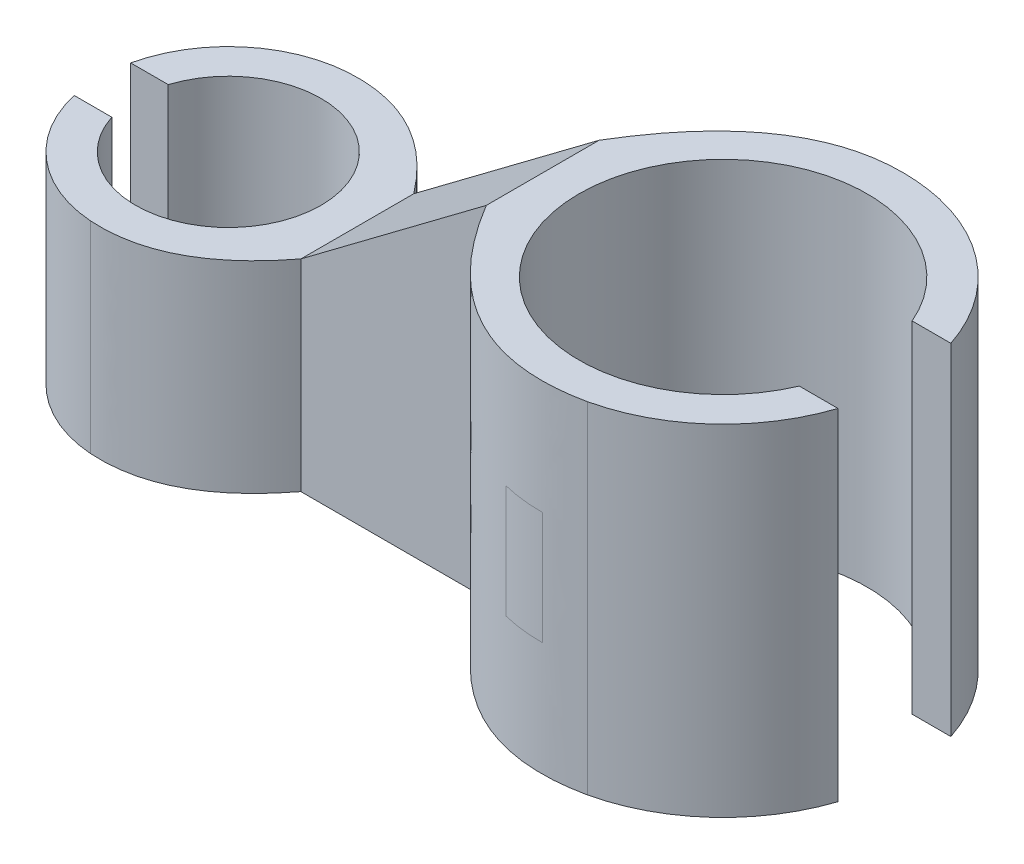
ISO-10303-21;
HEADER;
FILE_DESCRIPTION(('STEP AP214'),'2;1');
FILE_NAME('part.step','',(''),(''),'','','');
FILE_SCHEMA(('AUTOMOTIVE_DESIGN { 1 0 10303 214 1 1 1 1 }'));
ENDSEC;
DATA;
#1=APPLICATION_CONTEXT('core data for automotive mechanical design processes');
#2=APPLICATION_PROTOCOL_DEFINITION('international standard','automotive_design',2000,#1);
#3=PRODUCT_CONTEXT('',#1,'mechanical');
#4=PRODUCT('Part','Part','',(#3));
#5=PRODUCT_RELATED_PRODUCT_CATEGORY('part','',(#4));
#6=PRODUCT_DEFINITION_FORMATION('','',#4);
#7=PRODUCT_DEFINITION_CONTEXT('part definition',#1,'design');
#8=PRODUCT_DEFINITION('design','',#6,#7);
#9=PRODUCT_DEFINITION_SHAPE('','',#8);
#10=(LENGTH_UNIT() NAMED_UNIT(*) SI_UNIT(.MILLI.,.METRE.));
#11=(NAMED_UNIT(*) PLANE_ANGLE_UNIT() SI_UNIT($,.RADIAN.));
#12=(NAMED_UNIT(*) SI_UNIT($,.STERADIAN.) SOLID_ANGLE_UNIT());
#13=UNCERTAINTY_MEASURE_WITH_UNIT(LENGTH_MEASURE(1.E-05),#10,'distance_accuracy_value','');
#14=(GEOMETRIC_REPRESENTATION_CONTEXT(3) GLOBAL_UNCERTAINTY_ASSIGNED_CONTEXT((#13)) GLOBAL_UNIT_ASSIGNED_CONTEXT((#10,
#11,#12)) REPRESENTATION_CONTEXT('',''));
#15=CARTESIAN_POINT('',(0.,0.,0.));
#16=DIRECTION('',(0.,0.,1.));
#17=DIRECTION('',(1.,0.,0.));
#18=AXIS2_PLACEMENT_3D('',#15,#16,#17);
#19=CARTESIAN_POINT('',(0.,16.9,0.));
#20=DIRECTION('',(0.,-1.,0.));
#21=DIRECTION('',(0.,0.,-1.));
#22=AXIS2_PLACEMENT_3D('',#19,#20,#21);
#23=PLANE('',#22);
#24=CARTESIAN_POINT('',(20.4539037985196,16.9,11.2879795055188));
#25=CARTESIAN_POINT('',(19.3948134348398,16.9,11.2948853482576));
#26=CARTESIAN_POINT('',(18.3988784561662,16.9,11.0488560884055));
#27=B_SPLINE_CURVE_WITH_KNOTS('',2,(#24,#25,#26),.UNSPECIFIED.,.F.,.F.,(3,3),(0.673496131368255,
0.843641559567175),.UNSPECIFIED.);
#28=CARTESIAN_POINT('',(18.3988784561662,16.9,11.0488560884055));
#29=VERTEX_POINT('',#28);
#30=CARTESIAN_POINT('',(20.4539037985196,16.9,11.2879795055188));
#31=VERTEX_POINT('',#30);
#32=EDGE_CURVE('E11',#29,#31,#27,.F.);
#33=ORIENTED_EDGE('',*,*,#32,.T.);
#34=CARTESIAN_POINT('',(11.5039037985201,16.9,5.13797950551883));
#35=CARTESIAN_POINT('',(15.8880562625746,16.9,12.4683931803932));
#36=CARTESIAN_POINT('',(22.4537820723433,16.9,11.061682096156));
#37=B_SPLINE_CURVE_WITH_KNOTS('',2,(#34,#35,#36),.UNSPECIFIED.,.F.,.F.,(3,3),(0.,1.),.UNSPECIFIED.);
#38=CARTESIAN_POINT('',(22.4537820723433,16.9,11.061682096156));
#39=VERTEX_POINT('',#38);
#40=EDGE_CURVE('E331',#31,#39,#37,.T.);
#41=ORIENTED_EDGE('',*,*,#40,.T.);
#42=CARTESIAN_POINT('',(20.4539037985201,16.9,2.33797950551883));
#43=DIRECTION('',(0.,-1.,0.));
#44=DIRECTION('',(0.,0.,-1.));
#45=AXIS2_PLACEMENT_3D('',#42,#43,#44);
#46=CIRCLE('',#45,8.95);
#47=CARTESIAN_POINT('',(28.9546390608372,16.9,5.13797950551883));
#48=VERTEX_POINT('',#47);
#49=EDGE_CURVE('E242',#39,#48,#46,.F.);
#50=ORIENTED_EDGE('',*,*,#49,.T.);
#51=DIRECTION('',(1.,0.,0.));
#52=VECTOR('',#51,1.);
#53=CARTESIAN_POINT('',(25.013022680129,16.9,5.13797950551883));
#54=LINE('',#53,#52);
#55=CARTESIAN_POINT('',(27.0328474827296,16.9,5.13797950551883));
#56=VERTEX_POINT('',#55);
#57=EDGE_CURVE('E448',#56,#48,#54,.T.);
#58=ORIENTED_EDGE('',*,*,#57,.F.);
#59=CARTESIAN_POINT('',(20.4539037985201,16.9,2.33797950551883));
#60=DIRECTION('',(0.,-1.,0.));
#61=DIRECTION('',(0.,0.,-1.));
#62=AXIS2_PLACEMENT_3D('',#59,#60,#61);
#63=CIRCLE('',#62,7.15);
#64=CARTESIAN_POINT('',(27.0328474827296,16.9,-0.462020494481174));
#65=VERTEX_POINT('',#64);
#66=EDGE_CURVE('E295',#56,#65,#63,.T.);
#67=ORIENTED_EDGE('',*,*,#66,.T.);
#68=DIRECTION('',(-1.,0.,0.));
#69=VECTOR('',#68,1.);
#70=CARTESIAN_POINT('',(25.013022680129,16.9,-0.462020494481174));
#71=LINE('',#70,#69);
#72=CARTESIAN_POINT('',(28.9546390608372,16.9,-0.462020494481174));
#73=VERTEX_POINT('',#72);
#74=EDGE_CURVE('E446',#73,#65,#71,.T.);
#75=ORIENTED_EDGE('',*,*,#74,.F.);
#76=CARTESIAN_POINT('',(22.4537820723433,16.9,-6.38572308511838));
#77=VERTEX_POINT('',#76);
#78=EDGE_CURVE('E254',#73,#77,#46,.F.);
#79=ORIENTED_EDGE('',*,*,#78,.T.);
#80=CARTESIAN_POINT('',(11.5039037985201,16.9,-0.462020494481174));
#81=CARTESIAN_POINT('',(15.8880562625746,16.9,-7.7924341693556));
#82=CARTESIAN_POINT('',(22.4537820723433,16.9,-6.38572308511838));
#83=B_SPLINE_CURVE_WITH_KNOTS('',2,(#80,#81,#82),.UNSPECIFIED.,.F.,.F.,(3,3),(0.,1.),.UNSPECIFIED.);
#84=CARTESIAN_POINT('',(20.4539037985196,16.9,-6.61202049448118));
#85=VERTEX_POINT('',#84);
#86=EDGE_CURVE('E255',#85,#77,#83,.T.);
#87=ORIENTED_EDGE('',*,*,#86,.F.);
#88=CARTESIAN_POINT('',(18.3988784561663,16.9,-6.37289707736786));
#89=CARTESIAN_POINT('',(19.3948134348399,16.9,-6.61892633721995));
#90=CARTESIAN_POINT('',(20.4539037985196,16.9,-6.61202049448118));
#91=B_SPLINE_CURVE_WITH_KNOTS('',2,(#88,#89,#90),.UNSPECIFIED.,.F.,.F.,(3,3),(0.673496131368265,
0.843641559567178),.UNSPECIFIED.);
#92=CARTESIAN_POINT('',(18.3988784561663,16.9,-6.37289707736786));
#93=VERTEX_POINT('',#92);
#94=EDGE_CURVE('E50',#93,#85,#91,.T.);
#95=ORIENTED_EDGE('',*,*,#94,.F.);
#96=CARTESIAN_POINT('',(11.5039037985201,16.9,-0.462020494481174));
#97=VERTEX_POINT('',#96);
#98=EDGE_CURVE('E251',#97,#93,#83,.T.);
#99=ORIENTED_EDGE('',*,*,#98,.F.);
#100=DIRECTION('',(0.,0.,1.));
#101=VECTOR('',#100,1.);
#102=CARTESIAN_POINT('',(11.5039037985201,16.9,0.));
#103=LINE('',#102,#101);
#104=CARTESIAN_POINT('',(11.5039037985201,16.9,5.13797950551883));
#105=VERTEX_POINT('',#104);
#106=EDGE_CURVE('E241',#97,#105,#103,.T.);
#107=ORIENTED_EDGE('',*,*,#106,.T.);
#108=EDGE_CURVE('E400',#105,#29,#37,.T.);
#109=ORIENTED_EDGE('',*,*,#108,.T.);
#110=EDGE_LOOP('',(#33,#41,#50,#58,#67,#75,#79,#87,#95,#99,#107,#109));
#111=FACE_BOUND('',#110,.T.);
#112=ADVANCED_FACE('F39',(#111),#23,.F.);
#113=CARTESIAN_POINT('',(20.4539037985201,16.9,2.33797950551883));
#114=DIRECTION('',(0.,-1.,0.));
#115=DIRECTION('',(0.,0.,-1.));
#116=AXIS2_PLACEMENT_3D('',#113,#114,#115);
#117=CYLINDRICAL_SURFACE('',#116,8.95);
#118=ORIENTED_EDGE('',*,*,#78,.F.);
#119=DIRECTION('',(0.,-1.,0.));
#120=VECTOR('',#119,1.);
#121=CARTESIAN_POINT('',(28.9546390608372,16.9,-0.462020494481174));
#122=LINE('',#121,#120);
#123=CARTESIAN_POINT('',(28.9546390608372,0.,-0.462020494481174));
#124=VERTEX_POINT('',#123);
#125=EDGE_CURVE('E437',#73,#124,#122,.T.);
#126=ORIENTED_EDGE('',*,*,#125,.T.);
#127=CARTESIAN_POINT('',(20.4539037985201,0.,2.33797950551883));
#128=DIRECTION('',(0.,-1.,0.));
#129=DIRECTION('',(0.,0.,-1.));
#130=AXIS2_PLACEMENT_3D('',#127,#128,#129);
#131=CIRCLE('',#130,8.95);
#132=CARTESIAN_POINT('',(22.4537820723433,0.,-6.38572308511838));
#133=VERTEX_POINT('',#132);
#134=EDGE_CURVE('E322',#124,#133,#131,.F.);
#135=ORIENTED_EDGE('',*,*,#134,.T.);
#136=DIRECTION('',(0.,-1.,0.));
#137=VECTOR('',#136,1.);
#138=CARTESIAN_POINT('',(22.4537820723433,16.9,-6.38572308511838));
#139=LINE('',#138,#137);
#140=EDGE_CURVE('E303',#77,#133,#139,.T.);
#141=ORIENTED_EDGE('',*,*,#140,.F.);
#142=EDGE_LOOP('',(#118,#126,#135,#141));
#143=FACE_BOUND('',#142,.T.);
#144=ADVANCED_FACE('F282',(#143),#117,.T.);
#145=CARTESIAN_POINT('',(-4.09609620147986,10.,2.33797950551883));
#146=DIRECTION('',(0.,-1.,0.));
#147=DIRECTION('',(0.,0.,-1.));
#148=AXIS2_PLACEMENT_3D('',#145,#146,#147);
#149=CYLINDRICAL_SURFACE('',#148,6.4);
#150=CARTESIAN_POINT('',(-4.09609620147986,0.,2.33797950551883));
#151=DIRECTION('',(0.,1.,0.));
#152=DIRECTION('',(0.,0.,1.));
#153=AXIS2_PLACEMENT_3D('',#150,#151,#152);
#154=CIRCLE('',#153,6.4);
#155=CARTESIAN_POINT('',(-4.53794079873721,0.,-4.0467501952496));
#156=VERTEX_POINT('',#155);
#157=CARTESIAN_POINT('',(-10.3410941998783,0.,0.937979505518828));
#158=VERTEX_POINT('',#157);
#159=EDGE_CURVE('E371',#156,#158,#154,.T.);
#160=ORIENTED_EDGE('',*,*,#159,.T.);
#161=DIRECTION('',(0.,-1.,0.));
#162=VECTOR('',#161,1.);
#163=CARTESIAN_POINT('',(-10.3410941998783,10.,0.937979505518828));
#164=LINE('',#163,#162);
#165=CARTESIAN_POINT('',(-10.3410941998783,10.,0.937979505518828));
#166=VERTEX_POINT('',#165);
#167=EDGE_CURVE('E422',#158,#166,#164,.F.);
#168=ORIENTED_EDGE('',*,*,#167,.T.);
#169=CARTESIAN_POINT('',(-4.09609620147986,10.,2.33797950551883));
#170=DIRECTION('',(0.,1.,0.));
#171=DIRECTION('',(0.,0.,1.));
#172=AXIS2_PLACEMENT_3D('',#169,#170,#171);
#173=CIRCLE('',#172,6.4);
#174=CARTESIAN_POINT('',(-4.53794079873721,10.,-4.0467501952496));
#175=VERTEX_POINT('',#174);
#176=EDGE_CURVE('E551',#175,#166,#173,.T.);
#177=ORIENTED_EDGE('',*,*,#176,.F.);
#178=DIRECTION('',(0.,-1.,0.));
#179=VECTOR('',#178,1.);
#180=CARTESIAN_POINT('',(-4.53794079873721,10.,-4.0467501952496));
#181=LINE('',#180,#179);
#182=EDGE_CURVE('E384',#175,#156,#181,.T.);
#183=ORIENTED_EDGE('',*,*,#182,.T.);
#184=EDGE_LOOP('',(#160,#168,#177,#183));
#185=FACE_BOUND('',#184,.T.);
#186=ADVANCED_FACE('F573',(#185),#149,.T.);
#187=CARTESIAN_POINT('',(2.30390379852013,10.,5.13797950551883));
#188=CARTESIAN_POINT('',(-0.619440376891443,10.,8.97316679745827));
#189=CARTESIAN_POINT('',(-4.53794079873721,10.,8.72270920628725));
#190=B_SPLINE_CURVE_WITH_KNOTS('',2,(#187,#188,#189),.UNSPECIFIED.,.F.,.F.,(3,3),(0.,1.),.UNSPECIFIED.);
#191=DIRECTION('',(0.,-1.,0.));
#192=VECTOR('',#191,1.);
#193=SURFACE_OF_LINEAR_EXTRUSION('',#190,#192);
#194=CARTESIAN_POINT('',(2.30390379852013,0.,5.13797950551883));
#195=CARTESIAN_POINT('',(-0.619440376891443,0.,8.97316679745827));
#196=CARTESIAN_POINT('',(-4.53794079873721,0.,8.72270920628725));
#197=B_SPLINE_CURVE_WITH_KNOTS('',2,(#194,#195,#196),.UNSPECIFIED.,.F.,.F.,(3,3),(0.,1.),.UNSPECIFIED.);
#198=CARTESIAN_POINT('',(2.30390379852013,0.,5.13797950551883));
#199=VERTEX_POINT('',#198);
#200=CARTESIAN_POINT('',(-4.53794079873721,0.,8.72270920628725));
#201=VERTEX_POINT('',#200);
#202=EDGE_CURVE('E333',#199,#201,#197,.T.);
#203=ORIENTED_EDGE('',*,*,#202,.F.);
#204=DIRECTION('',(0.,-1.,0.));
#205=VECTOR('',#204,1.);
#206=CARTESIAN_POINT('',(2.30390379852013,10.,5.13797950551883));
#207=LINE('',#206,#205);
#208=CARTESIAN_POINT('',(2.30390379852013,10.,5.13797950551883));
#209=VERTEX_POINT('',#208);
#210=EDGE_CURVE('E392',#209,#199,#207,.T.);
#211=ORIENTED_EDGE('',*,*,#210,.F.);
#212=CARTESIAN_POINT('',(-4.53794079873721,10.,8.72270920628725));
#213=VERTEX_POINT('',#212);
#214=EDGE_CURVE('E380',#209,#213,#190,.T.);
#215=ORIENTED_EDGE('',*,*,#214,.T.);
#216=DIRECTION('',(0.,-1.,0.));
#217=VECTOR('',#216,1.);
#218=CARTESIAN_POINT('',(-4.53794079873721,10.,8.72270920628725));
#219=LINE('',#218,#217);
#220=EDGE_CURVE('E381',#213,#201,#219,.T.);
#221=ORIENTED_EDGE('',*,*,#220,.T.);
#222=EDGE_LOOP('',(#203,#211,#215,#221));
#223=FACE_BOUND('',#222,.T.);
#224=ADVANCED_FACE('F41',(#223),#193,.T.);
#225=CARTESIAN_POINT('',(0.,10.,5.13797950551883));
#226=DIRECTION('',(0.,0.,-1.));
#227=DIRECTION('',(-1.,0.,0.));
#228=AXIS2_PLACEMENT_3D('',#225,#226,#227);
#229=PLANE('',#228);
#230=DIRECTION('',(1.,0.,0.));
#231=VECTOR('',#230,1.);
#232=CARTESIAN_POINT('',(0.,0.,5.13797950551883));
#233=LINE('',#232,#231);
#234=CARTESIAN_POINT('',(11.5039037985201,0.,5.13797950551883));
#235=VERTEX_POINT('',#234);
#236=EDGE_CURVE('E346',#199,#235,#233,.T.);
#237=ORIENTED_EDGE('',*,*,#236,.T.);
#238=DIRECTION('',(0.,-1.,0.));
#239=VECTOR('',#238,1.);
#240=CARTESIAN_POINT('',(11.5039037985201,10.,5.13797950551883));
#241=LINE('',#240,#239);
#242=EDGE_CURVE('E44',#105,#235,#241,.T.);
#243=ORIENTED_EDGE('',*,*,#242,.F.);
#244=DIRECTION('',(0.8,0.6,0.));
#245=VECTOR('',#244,1.);
#246=CARTESIAN_POINT('',(2.30390379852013,10.,5.13797950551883));
#247=LINE('',#246,#245);
#248=EDGE_CURVE('E414',#209,#105,#247,.T.);
#249=ORIENTED_EDGE('',*,*,#248,.F.);
#250=ORIENTED_EDGE('',*,*,#210,.T.);
#251=EDGE_LOOP('',(#237,#243,#249,#250));
#252=FACE_BOUND('',#251,.T.);
#253=ADVANCED_FACE('F519',(#252),#229,.F.);
#254=CARTESIAN_POINT('',(0.,10.,-0.462020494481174));
#255=DIRECTION('',(0.,0.,-1.));
#256=DIRECTION('',(-1.,0.,0.));
#257=AXIS2_PLACEMENT_3D('',#254,#255,#256);
#258=PLANE('',#257);
#259=DIRECTION('',(1.,0.,0.));
#260=VECTOR('',#259,1.);
#261=CARTESIAN_POINT('',(0.,0.,-0.462020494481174));
#262=LINE('',#261,#260);
#263=CARTESIAN_POINT('',(2.30390379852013,0.,-0.462020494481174));
#264=VERTEX_POINT('',#263);
#265=CARTESIAN_POINT('',(11.5039037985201,0.,-0.462020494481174));
#266=VERTEX_POINT('',#265);
#267=EDGE_CURVE('E353',#264,#266,#262,.T.);
#268=ORIENTED_EDGE('',*,*,#267,.F.);
#269=DIRECTION('',(0.,-1.,0.));
#270=VECTOR('',#269,1.);
#271=CARTESIAN_POINT('',(2.30390379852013,10.,-0.462020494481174));
#272=LINE('',#271,#270);
#273=CARTESIAN_POINT('',(2.30390379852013,10.,-0.462020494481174));
#274=VERTEX_POINT('',#273);
#275=EDGE_CURVE('E387',#274,#264,#272,.T.);
#276=ORIENTED_EDGE('',*,*,#275,.F.);
#277=DIRECTION('',(0.8,0.6,0.));
#278=VECTOR('',#277,1.);
#279=CARTESIAN_POINT('',(2.30390379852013,10.,-0.462020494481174));
#280=LINE('',#279,#278);
#281=EDGE_CURVE('E415',#274,#97,#280,.T.);
#282=ORIENTED_EDGE('',*,*,#281,.T.);
#283=DIRECTION('',(0.,-1.,0.));
#284=VECTOR('',#283,1.);
#285=CARTESIAN_POINT('',(11.5039037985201,10.,-0.462020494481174));
#286=LINE('',#285,#284);
#287=EDGE_CURVE('E389',#97,#266,#286,.T.);
#288=ORIENTED_EDGE('',*,*,#287,.T.);
#289=EDGE_LOOP('',(#268,#276,#282,#288));
#290=FACE_BOUND('',#289,.T.);
#291=ADVANCED_FACE('F539',(#290),#258,.T.);
#292=CARTESIAN_POINT('',(2.30390379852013,10.,-0.462020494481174));
#293=CARTESIAN_POINT('',(-0.619440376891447,10.,-4.29720778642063));
#294=CARTESIAN_POINT('',(-4.53794079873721,10.,-4.0467501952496));
#295=B_SPLINE_CURVE_WITH_KNOTS('',2,(#292,#293,#294),.UNSPECIFIED.,.F.,.F.,(3,3),(0.,1.),.UNSPECIFIED.);
#296=DIRECTION('',(0.,-1.,0.));
#297=VECTOR('',#296,1.);
#298=SURFACE_OF_LINEAR_EXTRUSION('',#295,#297);
#299=CARTESIAN_POINT('',(2.30390379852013,0.,-0.462020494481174));
#300=CARTESIAN_POINT('',(-0.619440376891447,0.,-4.29720778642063));
#301=CARTESIAN_POINT('',(-4.53794079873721,0.,-4.0467501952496));
#302=B_SPLINE_CURVE_WITH_KNOTS('',2,(#299,#300,#301),.UNSPECIFIED.,.F.,.F.,(3,3),(0.,1.),.UNSPECIFIED.);
#303=EDGE_CURVE('E366',#264,#156,#302,.T.);
#304=ORIENTED_EDGE('',*,*,#303,.T.);
#305=ORIENTED_EDGE('',*,*,#182,.F.);
#306=EDGE_CURVE('E544',#274,#175,#295,.T.);
#307=ORIENTED_EDGE('',*,*,#306,.F.);
#308=ORIENTED_EDGE('',*,*,#275,.T.);
#309=EDGE_LOOP('',(#304,#305,#307,#308));
#310=FACE_BOUND('',#309,.T.);
#311=ADVANCED_FACE('F545',(#310),#298,.F.);
#312=CARTESIAN_POINT('',(-10.3410941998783,10.,3.73797950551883));
#313=VERTEX_POINT('',#312);
#314=EDGE_CURVE('E549',#313,#213,#173,.T.);
#315=ORIENTED_EDGE('',*,*,#314,.F.);
#316=DIRECTION('',(0.,-1.,0.));
#317=VECTOR('',#316,1.);
#318=CARTESIAN_POINT('',(-10.3410941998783,10.,3.73797950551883));
#319=LINE('',#318,#317);
#320=CARTESIAN_POINT('',(-10.3410941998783,0.,3.73797950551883));
#321=VERTEX_POINT('',#320);
#322=EDGE_CURVE('E429',#313,#321,#319,.T.);
#323=ORIENTED_EDGE('',*,*,#322,.T.);
#324=EDGE_CURVE('E370',#321,#201,#154,.T.);
#325=ORIENTED_EDGE('',*,*,#324,.T.);
#326=ORIENTED_EDGE('',*,*,#220,.F.);
#327=EDGE_LOOP('',(#315,#323,#325,#326));
#328=FACE_BOUND('',#327,.T.);
#329=ADVANCED_FACE('F566',(#328),#149,.T.);
#330=CARTESIAN_POINT('',(-4.09609620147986,10.,2.33797950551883));
#331=DIRECTION('',(0.,-1.,0.));
#332=DIRECTION('',(0.,0.,-1.));
#333=AXIS2_PLACEMENT_3D('',#330,#331,#332);
#334=CYLINDRICAL_SURFACE('',#333,4.6);
#335=DIRECTION('',(0.,-1.,0.));
#336=VECTOR('',#335,1.);
#337=CARTESIAN_POINT('',(-8.47787666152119,10.,0.937979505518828));
#338=LINE('',#337,#336);
#339=CARTESIAN_POINT('',(-8.47787666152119,0.,0.937979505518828));
#340=VERTEX_POINT('',#339);
#341=CARTESIAN_POINT('',(-8.47787666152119,10.,0.937979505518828));
#342=VERTEX_POINT('',#341);
#343=EDGE_CURVE('E425',#340,#342,#338,.F.);
#344=ORIENTED_EDGE('',*,*,#343,.F.);
#345=CARTESIAN_POINT('',(-4.09609620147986,0.,2.33797950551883));
#346=DIRECTION('',(0.,1.,0.));
#347=DIRECTION('',(0.,0.,1.));
#348=AXIS2_PLACEMENT_3D('',#345,#346,#347);
#349=CIRCLE('',#348,4.6);
#350=CARTESIAN_POINT('',(-8.47787666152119,0.,3.73797950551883));
#351=VERTEX_POINT('',#350);
#352=EDGE_CURVE('E377',#351,#340,#349,.T.);
#353=ORIENTED_EDGE('',*,*,#352,.F.);
#354=DIRECTION('',(0.,-1.,0.));
#355=VECTOR('',#354,1.);
#356=CARTESIAN_POINT('',(-8.47787666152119,10.,3.73797950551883));
#357=LINE('',#356,#355);
#358=CARTESIAN_POINT('',(-8.47787666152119,10.,3.73797950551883));
#359=VERTEX_POINT('',#358);
#360=EDGE_CURVE('E432',#359,#351,#357,.T.);
#361=ORIENTED_EDGE('',*,*,#360,.F.);
#362=CARTESIAN_POINT('',(-4.09609620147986,10.,2.33797950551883));
#363=DIRECTION('',(0.,1.,0.));
#364=DIRECTION('',(0.,0.,1.));
#365=AXIS2_PLACEMENT_3D('',#362,#363,#364);
#366=CIRCLE('',#365,4.6);
#367=EDGE_CURVE('E358',#359,#342,#366,.T.);
#368=ORIENTED_EDGE('',*,*,#367,.T.);
#369=EDGE_LOOP('',(#344,#353,#361,#368));
#370=FACE_BOUND('',#369,.T.);
#371=ADVANCED_FACE('F588',(#370),#334,.F.);
#372=CARTESIAN_POINT('',(0.,10.,0.));
#373=DIRECTION('',(0.,1.,0.));
#374=DIRECTION('',(0.,0.,1.));
#375=AXIS2_PLACEMENT_3D('',#372,#373,#374);
#376=PLANE('',#375);
#377=DIRECTION('',(-1.,0.,0.));
#378=VECTOR('',#377,1.);
#379=CARTESIAN_POINT('',(0.,10.,0.937979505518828));
#380=LINE('',#379,#378);
#381=EDGE_CURVE('E418',#342,#166,#380,.T.);
#382=ORIENTED_EDGE('',*,*,#381,.F.);
#383=ORIENTED_EDGE('',*,*,#367,.F.);
#384=DIRECTION('',(1.,0.,0.));
#385=VECTOR('',#384,1.);
#386=CARTESIAN_POINT('',(0.,10.,3.73797950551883));
#387=LINE('',#386,#385);
#388=EDGE_CURVE('E427',#313,#359,#387,.T.);
#389=ORIENTED_EDGE('',*,*,#388,.F.);
#390=ORIENTED_EDGE('',*,*,#314,.T.);
#391=ORIENTED_EDGE('',*,*,#214,.F.);
#392=DIRECTION('',(0.,0.,-1.));
#393=VECTOR('',#392,1.);
#394=CARTESIAN_POINT('',(2.30390379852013,10.,5.13797950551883));
#395=LINE('',#394,#393);
#396=EDGE_CURVE('E314',#209,#274,#395,.T.);
#397=ORIENTED_EDGE('',*,*,#396,.T.);
#398=ORIENTED_EDGE('',*,*,#306,.T.);
#399=ORIENTED_EDGE('',*,*,#176,.T.);
#400=EDGE_LOOP('',(#382,#383,#389,#390,#391,#397,#398,#399));
#401=FACE_BOUND('',#400,.T.);
#402=ADVANCED_FACE('F594',(#401),#376,.T.);
#403=CARTESIAN_POINT('',(0.,0.,0.));
#404=DIRECTION('',(0.,1.,0.));
#405=DIRECTION('',(0.,0.,1.));
#406=AXIS2_PLACEMENT_3D('',#403,#404,#405);
#407=PLANE('',#406);
#408=ORIENTED_EDGE('',*,*,#134,.F.);
#409=DIRECTION('',(-1.,0.,0.));
#410=VECTOR('',#409,1.);
#411=CARTESIAN_POINT('',(0.,0.,-0.462020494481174));
#412=LINE('',#411,#410);
#413=CARTESIAN_POINT('',(27.0328474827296,0.,-0.462020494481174));
#414=VERTEX_POINT('',#413);
#415=EDGE_CURVE('E434',#124,#414,#412,.T.);
#416=ORIENTED_EDGE('',*,*,#415,.T.);
#417=CARTESIAN_POINT('',(20.4539037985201,0.,2.33797950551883));
#418=DIRECTION('',(0.,-1.,0.));
#419=DIRECTION('',(0.,0.,-1.));
#420=AXIS2_PLACEMENT_3D('',#417,#418,#419);
#421=CIRCLE('',#420,7.15);
#422=CARTESIAN_POINT('',(27.0328474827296,0.,5.13797950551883));
#423=VERTEX_POINT('',#422);
#424=EDGE_CURVE('E329',#423,#414,#421,.T.);
#425=ORIENTED_EDGE('',*,*,#424,.F.);
#426=DIRECTION('',(1.,0.,0.));
#427=VECTOR('',#426,1.);
#428=CARTESIAN_POINT('',(0.,0.,5.13797950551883));
#429=LINE('',#428,#427);
#430=CARTESIAN_POINT('',(28.9546390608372,0.,5.13797950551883));
#431=VERTEX_POINT('',#430);
#432=EDGE_CURVE('E440',#423,#431,#429,.T.);
#433=ORIENTED_EDGE('',*,*,#432,.T.);
#434=CARTESIAN_POINT('',(22.4537820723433,0.,11.061682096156));
#435=VERTEX_POINT('',#434);
#436=EDGE_CURVE('E323',#435,#431,#131,.F.);
#437=ORIENTED_EDGE('',*,*,#436,.F.);
#438=CARTESIAN_POINT('',(11.5039037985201,0.,5.13797950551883));
#439=CARTESIAN_POINT('',(15.8880562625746,0.,12.4683931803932));
#440=CARTESIAN_POINT('',(22.4537820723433,0.,11.061682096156));
#441=B_SPLINE_CURVE_WITH_KNOTS('',2,(#438,#439,#440),.UNSPECIFIED.,.F.,.F.,(3,3),(0.,1.),.UNSPECIFIED.);
#442=EDGE_CURVE('E308',#235,#435,#441,.T.);
#443=ORIENTED_EDGE('',*,*,#442,.F.);
#444=ORIENTED_EDGE('',*,*,#236,.F.);
#445=ORIENTED_EDGE('',*,*,#202,.T.);
#446=ORIENTED_EDGE('',*,*,#324,.F.);
#447=DIRECTION('',(1.,0.,0.));
#448=VECTOR('',#447,1.);
#449=CARTESIAN_POINT('',(0.,0.,3.73797950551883));
#450=LINE('',#449,#448);
#451=EDGE_CURVE('E394',#321,#351,#450,.T.);
#452=ORIENTED_EDGE('',*,*,#451,.T.);
#453=ORIENTED_EDGE('',*,*,#352,.T.);
#454=DIRECTION('',(-1.,0.,0.));
#455=VECTOR('',#454,1.);
#456=CARTESIAN_POINT('',(0.,0.,0.937979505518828));
#457=LINE('',#456,#455);
#458=EDGE_CURVE('E397',#340,#158,#457,.T.);
#459=ORIENTED_EDGE('',*,*,#458,.T.);
#460=ORIENTED_EDGE('',*,*,#159,.F.);
#461=ORIENTED_EDGE('',*,*,#303,.F.);
#462=ORIENTED_EDGE('',*,*,#267,.T.);
#463=CARTESIAN_POINT('',(11.5039037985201,0.,-0.462020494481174));
#464=CARTESIAN_POINT('',(15.8880562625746,0.,-7.7924341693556));
#465=CARTESIAN_POINT('',(22.4537820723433,0.,-6.38572308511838));
#466=B_SPLINE_CURVE_WITH_KNOTS('',2,(#463,#464,#465),.UNSPECIFIED.,.F.,.F.,(3,3),(0.,1.),.UNSPECIFIED.);
#467=EDGE_CURVE('E313',#266,#133,#466,.T.);
#468=ORIENTED_EDGE('',*,*,#467,.T.);
#469=EDGE_LOOP('',(#408,#416,#425,#433,#437,#443,#444,#445,#446,#452,#453,#459,#460,#461,#462,#468));
#470=FACE_BOUND('',#469,.T.);
#471=ADVANCED_FACE('F515',(#470),#407,.F.);
#472=DIRECTION('',(0.,-1.,0.));
#473=VECTOR('',#472,1.);
#474=SURFACE_OF_LINEAR_EXTRUSION('',#37,#473);
#475=DIRECTION('',(0.,1.,0.));
#476=VECTOR('',#475,1.);
#477=CARTESIAN_POINT('',(20.4539037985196,1.89999999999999,11.2879795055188));
#478=LINE('',#477,#476);
#479=CARTESIAN_POINT('',(20.4539037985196,5.65,11.2879795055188));
#480=VERTEX_POINT('',#479);
#481=CARTESIAN_POINT('',(20.4539037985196,11.25,11.2879795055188));
#482=VERTEX_POINT('',#481);
#483=EDGE_CURVE('E204',#480,#482,#478,.T.);
#484=ORIENTED_EDGE('',*,*,#483,.F.);
#485=CARTESIAN_POINT('',(20.4539037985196,5.65,11.2879795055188));
#486=CARTESIAN_POINT('',(19.3948134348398,5.65,11.2948853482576));
#487=CARTESIAN_POINT('',(18.3988784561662,5.65,11.0488560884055));
#488=B_SPLINE_CURVE_WITH_KNOTS('',2,(#485,#486,#487),.UNSPECIFIED.,.F.,.F.,(3,3),
(0.673496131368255,0.843641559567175),.UNSPECIFIED.);
#489=CARTESIAN_POINT('',(18.3988784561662,5.65,11.0488560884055));
#490=VERTEX_POINT('',#489);
#491=EDGE_CURVE('E203',#490,#480,#488,.F.);
#492=ORIENTED_EDGE('',*,*,#491,.F.);
#493=DIRECTION('',(0.,1.,0.));
#494=VECTOR('',#493,1.);
#495=CARTESIAN_POINT('',(18.3988784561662,1.89999999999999,11.0488560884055));
#496=LINE('',#495,#494);
#497=CARTESIAN_POINT('',(18.3988784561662,11.25,11.0488560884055));
#498=VERTEX_POINT('',#497);
#499=EDGE_CURVE('E495',#490,#498,#496,.T.);
#500=ORIENTED_EDGE('',*,*,#499,.T.);
#501=CARTESIAN_POINT('',(18.3988784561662,11.25,11.0488560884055));
#502=CARTESIAN_POINT('',(19.3948134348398,11.25,11.2948853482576));
#503=CARTESIAN_POINT('',(20.4539037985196,11.25,11.2879795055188));
#504=B_SPLINE_CURVE_WITH_KNOTS('',2,(#501,#502,#503),.UNSPECIFIED.,.F.,.F.,(3,3),
(0.673496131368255,0.843641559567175),.UNSPECIFIED.);
#505=EDGE_CURVE('E492',#498,#482,#504,.T.);
#506=ORIENTED_EDGE('',*,*,#505,.T.);
#507=EDGE_LOOP('',(#484,#492,#500,#506));
#508=FACE_BOUND('',#507,.T.);
#509=ORIENTED_EDGE('',*,*,#242,.T.);
#510=ORIENTED_EDGE('',*,*,#442,.T.);
#511=DIRECTION('',(0.,-1.,0.));
#512=VECTOR('',#511,1.);
#513=CARTESIAN_POINT('',(22.4537820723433,16.9,11.061682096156));
#514=LINE('',#513,#512);
#515=EDGE_CURVE('E304',#39,#435,#514,.T.);
#516=ORIENTED_EDGE('',*,*,#515,.F.);
#517=ORIENTED_EDGE('',*,*,#40,.F.);
#518=ORIENTED_EDGE('',*,*,#32,.F.);
#519=ORIENTED_EDGE('',*,*,#108,.F.);
#520=EDGE_LOOP('',(#509,#510,#516,#517,#518,#519));
#521=FACE_BOUND('',#520,.T.);
#522=ADVANCED_FACE('F229',(#508,#521),#474,.F.);
#523=ORIENTED_EDGE('',*,*,#515,.T.);
#524=ORIENTED_EDGE('',*,*,#436,.T.);
#525=DIRECTION('',(0.,-1.,0.));
#526=VECTOR('',#525,1.);
#527=CARTESIAN_POINT('',(28.9546390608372,16.9,5.13797950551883));
#528=LINE('',#527,#526);
#529=EDGE_CURVE('E443',#431,#48,#528,.F.);
#530=ORIENTED_EDGE('',*,*,#529,.T.);
#531=ORIENTED_EDGE('',*,*,#49,.F.);
#532=EDGE_LOOP('',(#523,#524,#530,#531));
#533=FACE_BOUND('',#532,.T.);
#534=ADVANCED_FACE('F227',(#533),#117,.T.);
#535=DIRECTION('',(0.,-1.,0.));
#536=VECTOR('',#535,1.);
#537=SURFACE_OF_LINEAR_EXTRUSION('',#83,#536);
#538=CARTESIAN_POINT('',(18.3988784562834,5.65,-6.37289707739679));
#539=CARTESIAN_POINT('',(19.3948134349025,5.65,-6.61892633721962));
#540=CARTESIAN_POINT('',(20.4539037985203,5.65,-6.61202049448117));
#541=B_SPLINE_CURVE_WITH_KNOTS('',2,(#538,#539,#540),.UNSPECIFIED.,.F.,.F.,(3,3),
(0.673496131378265,0.843641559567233),.UNSPECIFIED.);
#542=CARTESIAN_POINT('',(20.4539037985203,5.65,-6.61202049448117));
#543=VERTEX_POINT('',#542);
#544=CARTESIAN_POINT('',(18.3988784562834,5.65,-6.37289707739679));
#545=VERTEX_POINT('',#544);
#546=EDGE_CURVE('E191',#543,#545,#541,.F.);
#547=ORIENTED_EDGE('',*,*,#546,.F.);
#548=DIRECTION('',(0.,1.,0.));
#549=VECTOR('',#548,1.);
#550=CARTESIAN_POINT('',(20.4539037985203,1.89999999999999,-6.61202049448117));
#551=LINE('',#550,#549);
#552=CARTESIAN_POINT('',(20.4539037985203,11.25,-6.61202049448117));
#553=VERTEX_POINT('',#552);
#554=EDGE_CURVE('E188',#543,#553,#551,.T.);
#555=ORIENTED_EDGE('',*,*,#554,.T.);
#556=CARTESIAN_POINT('',(20.4539037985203,11.25,-6.61202049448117));
#557=CARTESIAN_POINT('',(19.3948134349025,11.25,-6.61892633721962));
#558=CARTESIAN_POINT('',(18.3988784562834,11.25,-6.37289707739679));
#559=B_SPLINE_CURVE_WITH_KNOTS('',2,(#556,#557,#558),.UNSPECIFIED.,.F.,.F.,(3,3),
(0.673496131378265,0.843641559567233),.UNSPECIFIED.);
#560=CARTESIAN_POINT('',(18.3988784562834,11.25,-6.37289707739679));
#561=VERTEX_POINT('',#560);
#562=EDGE_CURVE('E195',#553,#561,#559,.T.);
#563=ORIENTED_EDGE('',*,*,#562,.T.);
#564=DIRECTION('',(0.,1.,0.));
#565=VECTOR('',#564,1.);
#566=CARTESIAN_POINT('',(18.3988784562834,1.89999999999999,-6.37289707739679));
#567=LINE('',#566,#565);
#568=EDGE_CURVE('E198',#545,#561,#567,.T.);
#569=ORIENTED_EDGE('',*,*,#568,.F.);
#570=EDGE_LOOP('',(#547,#555,#563,#569));
#571=FACE_BOUND('',#570,.T.);
#572=ORIENTED_EDGE('',*,*,#467,.F.);
#573=ORIENTED_EDGE('',*,*,#287,.F.);
#574=ORIENTED_EDGE('',*,*,#98,.T.);
#575=ORIENTED_EDGE('',*,*,#94,.T.);
#576=ORIENTED_EDGE('',*,*,#86,.T.);
#577=ORIENTED_EDGE('',*,*,#140,.T.);
#578=EDGE_LOOP('',(#572,#573,#574,#575,#576,#577));
#579=FACE_BOUND('',#578,.T.);
#580=ADVANCED_FACE('F201',(#571,#579),#537,.T.);
#581=CARTESIAN_POINT('',(20.4539037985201,16.9,2.33797950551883));
#582=DIRECTION('',(0.,-1.,0.));
#583=DIRECTION('',(0.,0.,-1.));
#584=AXIS2_PLACEMENT_3D('',#581,#582,#583);
#585=CYLINDRICAL_SURFACE('',#584,7.15);
#586=ORIENTED_EDGE('',*,*,#66,.F.);
#587=DIRECTION('',(0.,-1.,0.));
#588=VECTOR('',#587,1.);
#589=CARTESIAN_POINT('',(27.0328474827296,16.9,5.13797950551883));
#590=LINE('',#589,#588);
#591=EDGE_CURVE('E297',#56,#423,#590,.T.);
#592=ORIENTED_EDGE('',*,*,#591,.T.);
#593=ORIENTED_EDGE('',*,*,#424,.T.);
#594=DIRECTION('',(0.,-1.,0.));
#595=VECTOR('',#594,1.);
#596=CARTESIAN_POINT('',(27.0328474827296,16.9,-0.462020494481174));
#597=LINE('',#596,#595);
#598=EDGE_CURVE('E299',#414,#65,#597,.F.);
#599=ORIENTED_EDGE('',*,*,#598,.T.);
#600=EDGE_LOOP('',(#586,#592,#593,#599));
#601=FACE_BOUND('',#600,.T.);
#602=ADVANCED_FACE('F226',(#601),#585,.F.);
#603=CARTESIAN_POINT('',(2.30390379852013,10.,5.13797950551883));
#604=DIRECTION('',(-0.6,0.8,0.));
#605=DIRECTION('',(-0.8,-0.6,0.));
#606=AXIS2_PLACEMENT_3D('',#603,#604,#605);
#607=PLANE('',#606);
#608=ORIENTED_EDGE('',*,*,#281,.F.);
#609=ORIENTED_EDGE('',*,*,#396,.F.);
#610=ORIENTED_EDGE('',*,*,#248,.T.);
#611=ORIENTED_EDGE('',*,*,#106,.F.);
#612=EDGE_LOOP('',(#608,#609,#610,#611));
#613=FACE_BOUND('',#612,.T.);
#614=ADVANCED_FACE('F283',(#613),#607,.T.);
#615=CARTESIAN_POINT('',(-12.0850769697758,-1.70000000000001,3.73797950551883));
#616=DIRECTION('',(0.,0.,1.));
#617=DIRECTION('',(1.,0.,0.));
#618=AXIS2_PLACEMENT_3D('',#615,#616,#617);
#619=PLANE('',#618);
#620=ORIENTED_EDGE('',*,*,#388,.T.);
#621=ORIENTED_EDGE('',*,*,#360,.T.);
#622=ORIENTED_EDGE('',*,*,#451,.F.);
#623=ORIENTED_EDGE('',*,*,#322,.F.);
#624=EDGE_LOOP('',(#620,#621,#622,#623));
#625=FACE_BOUND('',#624,.T.);
#626=ADVANCED_FACE('F291',(#625),#619,.F.);
#627=CARTESIAN_POINT('',(-12.0850769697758,-1.70000000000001,0.937979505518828));
#628=DIRECTION('',(0.,0.,-1.));
#629=DIRECTION('',(-1.,0.,0.));
#630=AXIS2_PLACEMENT_3D('',#627,#628,#629);
#631=PLANE('',#630);
#632=ORIENTED_EDGE('',*,*,#381,.T.);
#633=ORIENTED_EDGE('',*,*,#167,.F.);
#634=ORIENTED_EDGE('',*,*,#458,.F.);
#635=ORIENTED_EDGE('',*,*,#343,.T.);
#636=EDGE_LOOP('',(#632,#633,#634,#635));
#637=FACE_BOUND('',#636,.T.);
#638=ADVANCED_FACE('F593',(#637),#631,.F.);
#639=CARTESIAN_POINT('',(25.013022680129,-1.70000000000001,5.13797950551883));
#640=DIRECTION('',(0.,0.,1.));
#641=DIRECTION('',(1.,0.,0.));
#642=AXIS2_PLACEMENT_3D('',#639,#640,#641);
#643=PLANE('',#642);
#644=ORIENTED_EDGE('',*,*,#57,.T.);
#645=ORIENTED_EDGE('',*,*,#529,.F.);
#646=ORIENTED_EDGE('',*,*,#432,.F.);
#647=ORIENTED_EDGE('',*,*,#591,.F.);
#648=EDGE_LOOP('',(#644,#645,#646,#647));
#649=FACE_BOUND('',#648,.T.);
#650=ADVANCED_FACE('F524',(#649),#643,.F.);
#651=CARTESIAN_POINT('',(25.013022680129,-1.70000000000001,-0.462020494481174));
#652=DIRECTION('',(0.,0.,-1.));
#653=DIRECTION('',(-1.,0.,0.));
#654=AXIS2_PLACEMENT_3D('',#651,#652,#653);
#655=PLANE('',#654);
#656=ORIENTED_EDGE('',*,*,#74,.T.);
#657=ORIENTED_EDGE('',*,*,#598,.F.);
#658=ORIENTED_EDGE('',*,*,#415,.F.);
#659=ORIENTED_EDGE('',*,*,#125,.F.);
#660=EDGE_LOOP('',(#656,#657,#658,#659));
#661=FACE_BOUND('',#660,.T.);
#662=ADVANCED_FACE('F465',(#661),#655,.F.);
#663=CARTESIAN_POINT('',(20.4539037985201,1.89999999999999,2.33797950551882));
#664=DIRECTION('',(0.,1.,0.));
#665=DIRECTION('',(0.,0.,1.));
#666=AXIS2_PLACEMENT_3D('',#663,#664,#665);
#667=CYLINDRICAL_SURFACE('',#666,8.95);
#668=ORIENTED_EDGE('',*,*,#499,.F.);
#669=ORIENTED_EDGE('',*,*,#491,.T.);
#670=ORIENTED_EDGE('',*,*,#483,.T.);
#671=ORIENTED_EDGE('',*,*,#505,.F.);
#672=EDGE_LOOP('',(#668,#669,#670,#671));
#673=FACE_BOUND('',#672,.T.);
#674=ADVANCED_FACE('F456',(#673),#667,.T.);
#675=ORIENTED_EDGE('',*,*,#554,.F.);
#676=ORIENTED_EDGE('',*,*,#546,.T.);
#677=ORIENTED_EDGE('',*,*,#568,.T.);
#678=ORIENTED_EDGE('',*,*,#562,.F.);
#679=EDGE_LOOP('',(#675,#676,#677,#678));
#680=FACE_BOUND('',#679,.T.);
#681=ADVANCED_FACE('F190',(#680),#667,.T.);
#682=CLOSED_SHELL('',(#112,#144,#186,#224,#253,#291,#311,#329,#371,#402,#471,#522,#534,#580,
#602,#614,#626,#638,#650,#662,#674,#681));
#683=MANIFOLD_SOLID_BREP('B2',#682);
#684=ADVANCED_BREP_SHAPE_REPRESENTATION('',(#18,#683),#14);
#685=SHAPE_DEFINITION_REPRESENTATION(#9,#684);
ENDSEC;
END-ISO-10303-21;
